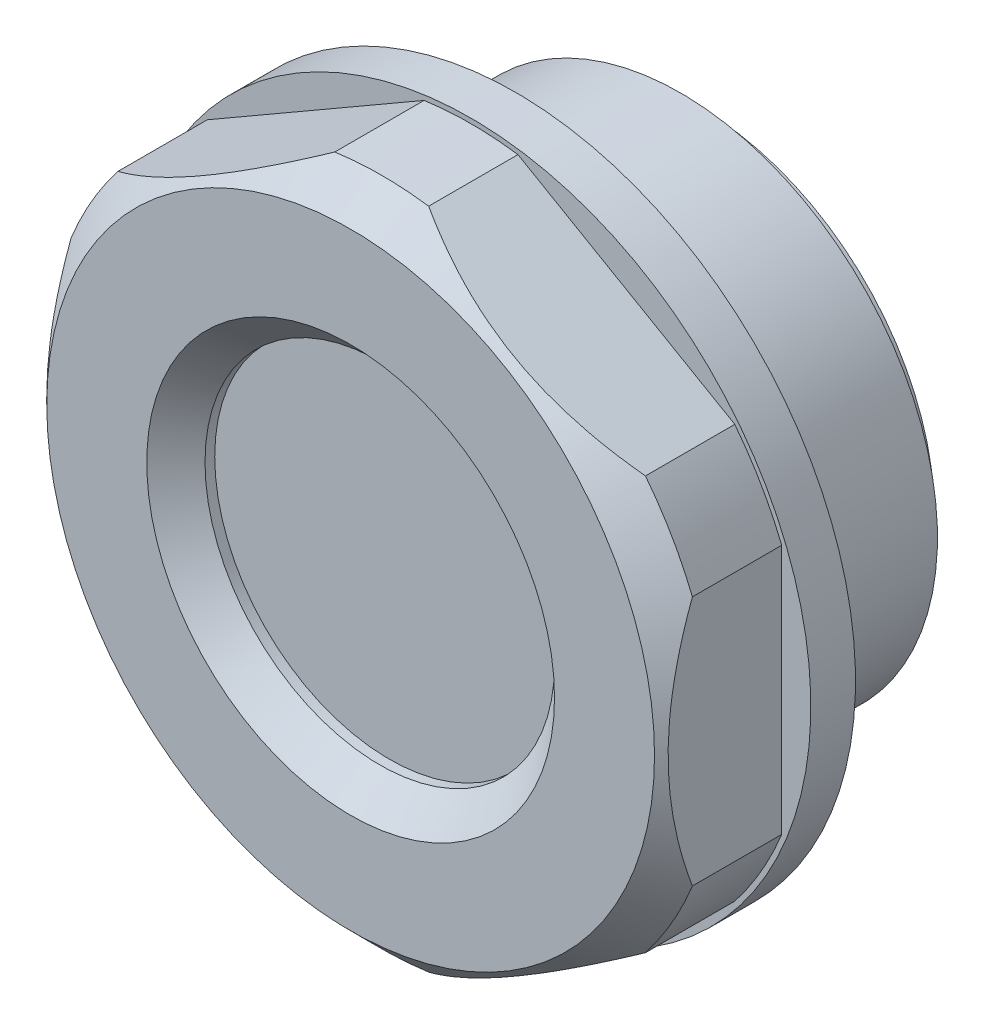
ISO-10303-21;
HEADER;
FILE_DESCRIPTION(('STEP AP214'),'2;1');
FILE_NAME('part.step','',(''),(''),'','','');
FILE_SCHEMA(('AUTOMOTIVE_DESIGN { 1 0 10303 214 1 1 1 1 }'));
ENDSEC;
DATA;
#1=APPLICATION_CONTEXT('core data for automotive mechanical design processes');
#2=APPLICATION_PROTOCOL_DEFINITION('international standard','automotive_design',2000,#1);
#3=PRODUCT_CONTEXT('',#1,'mechanical');
#4=PRODUCT('Part','Part','',(#3));
#5=PRODUCT_RELATED_PRODUCT_CATEGORY('part','',(#4));
#6=PRODUCT_DEFINITION_FORMATION('','',#4);
#7=PRODUCT_DEFINITION_CONTEXT('part definition',#1,'design');
#8=PRODUCT_DEFINITION('design','',#6,#7);
#9=PRODUCT_DEFINITION_SHAPE('','',#8);
#10=(LENGTH_UNIT() NAMED_UNIT(*) SI_UNIT(.MILLI.,.METRE.));
#11=(NAMED_UNIT(*) PLANE_ANGLE_UNIT() SI_UNIT($,.RADIAN.));
#12=(NAMED_UNIT(*) SI_UNIT($,.STERADIAN.) SOLID_ANGLE_UNIT());
#13=UNCERTAINTY_MEASURE_WITH_UNIT(LENGTH_MEASURE(1.E-05),#10,'distance_accuracy_value','');
#14=(GEOMETRIC_REPRESENTATION_CONTEXT(3) GLOBAL_UNCERTAINTY_ASSIGNED_CONTEXT((#13)) GLOBAL_UNIT_ASSIGNED_CONTEXT((#10,
#11,#12)) REPRESENTATION_CONTEXT('',''));
#15=CARTESIAN_POINT('',(0.,0.,0.));
#16=DIRECTION('',(0.,0.,1.));
#17=DIRECTION('',(1.,0.,0.));
#18=AXIS2_PLACEMENT_3D('',#15,#16,#17);
#19=CARTESIAN_POINT('',(-1.20657560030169E-13,0.,7.90000000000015));
#20=DIRECTION('',(0.,0.,-1.));
#21=DIRECTION('',(-1.,0.,0.));
#22=AXIS2_PLACEMENT_3D('',#19,#20,#21);
#23=CONICAL_SURFACE('',#22,17.25,0.785398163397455);
#24=CARTESIAN_POINT('',(-1.45094534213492E-13,0.,9.5));
#25=DIRECTION('',(0.,0.,-1.));
#26=DIRECTION('',(-1.,0.,0.));
#27=AXIS2_PLACEMENT_3D('',#24,#25,#26);
#28=CIRCLE('',#27,15.65);
#29=CARTESIAN_POINT('',(-15.6500000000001,0.,9.49999999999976));
#30=VERTEX_POINT('',#29);
#31=EDGE_CURVE('E256',#30,#30,#28,.T.);
#32=ORIENTED_EDGE('',*,*,#31,.T.);
#33=EDGE_LOOP('',(#32));
#34=FACE_BOUND('',#33,.T.);
#35=CARTESIAN_POINT('',(-1.20657560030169E-13,0.,7.90000000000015));
#36=DIRECTION('',(0.,0.,-1.));
#37=DIRECTION('',(-1.,0.,0.));
#38=AXIS2_PLACEMENT_3D('',#35,#36,#37);
#39=CIRCLE('',#38,17.25);
#40=CARTESIAN_POINT('',(-2.41682214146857,17.0798557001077,7.90000000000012));
#41=VERTEX_POINT('',#40);
#42=CARTESIAN_POINT('',(2.41682214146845,17.0798557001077,7.90000000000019));
#43=VERTEX_POINT('',#42);
#44=EDGE_CURVE('E257',#41,#43,#39,.T.);
#45=ORIENTED_EDGE('',*,*,#44,.F.);
#46=CARTESIAN_POINT('',(-2.41635871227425,17.0801232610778,7.89980000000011));
#47=CARTESIAN_POINT('',(-2.63984946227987,16.9510908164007,7.99624456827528));
#48=CARTESIAN_POINT('',(-2.86473179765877,16.8212549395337,8.08832370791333));
#49=CARTESIAN_POINT('',(-3.31735921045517,16.5599303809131,8.26286508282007));
#50=CARTESIAN_POINT('',(-3.54510524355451,16.4284411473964,8.34532400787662));
#51=CARTESIAN_POINT('',(-4.23352860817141,16.0309797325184,8.57718261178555));
#52=CARTESIAN_POINT('',(-4.69841380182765,15.7625781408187,8.71063418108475));
#53=CARTESIAN_POINT('',(-5.39388764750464,15.3610461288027,8.87148738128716));
#54=CARTESIAN_POINT('',(-5.62125425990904,15.2297759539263,8.91803441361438));
#55=CARTESIAN_POINT('',(-6.07760865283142,14.9662996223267,8.99884693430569));
#56=CARTESIAN_POINT('',(-6.30659618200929,14.8340936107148,9.03311428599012));
#57=CARTESIAN_POINT('',(-6.76547632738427,14.5691590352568,9.08878220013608));
#58=CARTESIAN_POINT('',(-6.99536760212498,14.4364312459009,9.11019749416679));
#59=CARTESIAN_POINT('',(-7.45578938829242,14.1706066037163,9.13986408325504));
#60=CARTESIAN_POINT('',(-7.6863198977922,14.0375097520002,9.14811541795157));
#61=CARTESIAN_POINT('',(-8.15412172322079,13.7674242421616,9.15135511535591));
#62=CARTESIAN_POINT('',(-8.3913951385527,13.6304343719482,9.14595293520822));
#63=CARTESIAN_POINT('',(-8.86539361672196,13.3567712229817,9.1211573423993));
#64=CARTESIAN_POINT('',(-9.10211867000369,13.2200979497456,9.10176368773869));
#65=CARTESIAN_POINT('',(-9.57473063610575,12.9472353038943,9.04930119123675));
#66=CARTESIAN_POINT('',(-9.81061608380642,12.8110467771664,9.0162148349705));
#67=CARTESIAN_POINT('',(-10.2807313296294,12.5396256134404,8.93693320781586));
#68=CARTESIAN_POINT('',(-10.5149610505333,12.4043930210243,8.89073732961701));
#69=CARTESIAN_POINT('',(-10.9900220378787,12.1301164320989,8.78402160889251));
#70=CARTESIAN_POINT('',(-11.2307738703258,11.9911182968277,8.72303196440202));
#71=CARTESIAN_POINT('',(-11.7096941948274,11.7146135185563,8.58868532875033));
#72=CARTESIAN_POINT('',(-11.9478623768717,11.5771070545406,8.51532687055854));
#73=CARTESIAN_POINT('',(-12.4207353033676,11.3040937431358,8.35747009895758));
#74=CARTESIAN_POINT('',(-12.6554473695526,11.1685826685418,8.27300086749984));
#75=CARTESIAN_POINT('',(-13.1218299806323,10.8993165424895,8.09382652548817));
#76=CARTESIAN_POINT('',(-13.3535016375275,10.7655608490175,7.9991252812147));
#77=CARTESIAN_POINT('',(-13.5836412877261,10.632689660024,7.8998));
#78=B_SPLINE_CURVE_WITH_KNOTS('',3,(#46,#47,#48,#49,#50,#51,#52,#53,#54,#55,#56,#57,#58,#59,#60,
#61,#62,#63,#64,#65,#66,#67,#68,#69,#70,#71,#72,#73,#74,#75,#76,#77),.UNSPECIFIED.,.F.,.F.,(4,2,
2,2,2,2,2,2,2,2,2,2,2,2,2,4),(0.,0.8263902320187,1.65306398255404,3.31002575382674,
4.10970222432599,4.90925730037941,5.70789413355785,6.50652856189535,7.32826394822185,
8.1500135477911,8.97281751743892,9.79565961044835,10.6491778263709,11.5027973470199,
12.3542254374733,13.2053329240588),.UNSPECIFIED.);
#79=CARTESIAN_POINT('',(-13.5831778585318,10.6329572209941,7.9));
#80=VERTEX_POINT('',#79);
#81=EDGE_CURVE('E123',#41,#80,#78,.T.);
#82=ORIENTED_EDGE('',*,*,#81,.T.);
#83=CARTESIAN_POINT('',(-16.,6.44689847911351,7.9));
#84=VERTEX_POINT('',#83);
#85=EDGE_CURVE('E122',#84,#80,#39,.T.);
#86=ORIENTED_EDGE('',*,*,#85,.F.);
#87=CARTESIAN_POINT('',(-16.,-18.6480764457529,0.578659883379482));
#88=CARTESIAN_POINT('',(-15.9999999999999,-18.4215574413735,0.750570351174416));
#89=CARTESIAN_POINT('',(-15.9999999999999,-18.1944022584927,0.921641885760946));
#90=CARTESIAN_POINT('',(-15.9999999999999,-17.7387144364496,1.26194848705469));
#91=CARTESIAN_POINT('',(-15.9999999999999,-17.510181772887,1.4311835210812));
#92=CARTESIAN_POINT('',(-15.9999999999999,-16.8222665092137,1.93596425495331));
#93=CARTESIAN_POINT('',(-15.9999999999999,-16.3606707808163,2.26850632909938));
#94=CARTESIAN_POINT('',(-15.9999999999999,-15.4270758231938,2.92649586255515));
#95=CARTESIAN_POINT('',(-15.9999999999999,-14.9550237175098,3.25186846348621));
#96=CARTESIAN_POINT('',(-15.9999999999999,-14.0029474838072,3.89069769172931));
#97=CARTESIAN_POINT('',(-15.9999999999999,-13.5229239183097,4.20415515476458));
#98=CARTESIAN_POINT('',(-16.,-12.5251227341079,4.83447992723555));
#99=CARTESIAN_POINT('',(-16.,-12.0067846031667,5.15046438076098));
#100=CARTESIAN_POINT('',(-16.,-10.9579857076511,5.76196555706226));
#101=CARTESIAN_POINT('',(-16.,-10.4275230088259,6.05747898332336));
#102=CARTESIAN_POINT('',(-16.,-9.35447527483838,6.62168298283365));
#103=CARTESIAN_POINT('',(-16.,-8.81193202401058,6.89045241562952));
#104=CARTESIAN_POINT('',(-16.,-7.71189356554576,7.39515029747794));
#105=CARTESIAN_POINT('',(-16.,-7.15440534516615,7.63109378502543));
#106=CARTESIAN_POINT('',(-16.,-6.07190242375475,8.0432913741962));
#107=CARTESIAN_POINT('',(-16.,-5.54818492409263,8.22292359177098));
#108=CARTESIAN_POINT('',(-16.0000000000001,-4.48784556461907,8.54020255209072));
#109=CARTESIAN_POINT('',(-16.0000000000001,-3.9512228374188,8.67784646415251));
#110=CARTESIAN_POINT('',(-16.0000000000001,-3.14356845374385,8.84619118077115));
#111=CARTESIAN_POINT('',(-16.0000000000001,-2.87637386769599,8.89566579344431));
#112=CARTESIAN_POINT('',(-16.0000000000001,-2.33996090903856,8.98196309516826));
#113=CARTESIAN_POINT('',(-16.0000000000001,-2.07074281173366,9.01878747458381));
#114=CARTESIAN_POINT('',(-16.0000000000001,-1.53083914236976,9.07917233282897));
#115=CARTESIAN_POINT('',(-16.0000000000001,-1.26015367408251,9.10273373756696));
#116=CARTESIAN_POINT('',(-16.0000000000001,-0.717935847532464,9.13618645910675));
#117=CARTESIAN_POINT('',(-16.,-0.446403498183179,9.14607791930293));
#118=CARTESIAN_POINT('',(-16.,0.0864482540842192,9.15189931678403));
#119=CARTESIAN_POINT('',(-16.0000000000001,0.347762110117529,9.14834746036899));
#120=CARTESIAN_POINT('',(-16.0000000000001,0.869931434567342,9.12849252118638));
#121=CARTESIAN_POINT('',(-16.0000000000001,1.13078684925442,9.11218803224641));
#122=CARTESIAN_POINT('',(-16.0000000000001,1.6514011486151,9.06709326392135));
#123=CARTESIAN_POINT('',(-16.0000000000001,1.91116008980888,9.03830363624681));
#124=CARTESIAN_POINT('',(-16.0000000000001,2.42907351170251,8.96869979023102));
#125=CARTESIAN_POINT('',(-16.0000000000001,2.68722778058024,8.9278840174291));
#126=CARTESIAN_POINT('',(-16.0000000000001,3.46755429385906,8.78663950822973));
#127=CARTESIAN_POINT('',(-16.0000000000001,3.98654918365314,8.66822454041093));
#128=CARTESIAN_POINT('',(-16.0000000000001,5.01311061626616,8.3903272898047));
#129=CARTESIAN_POINT('',(-16.,5.52067803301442,8.23084815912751));
#130=CARTESIAN_POINT('',(-16.,6.56542694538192,7.86283095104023));
#131=CARTESIAN_POINT('',(-16.0000000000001,7.10154915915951,7.65131116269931));
#132=CARTESIAN_POINT('',(-16.0000000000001,8.15990175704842,7.19573573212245));
#133=CARTESIAN_POINT('',(-16.0000000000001,8.68212559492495,6.95166507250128));
#134=CARTESIAN_POINT('',(-16.0000000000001,9.71521766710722,6.43678880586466));
#135=CARTESIAN_POINT('',(-16.0000000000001,10.2260439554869,6.1658997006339));
#136=CARTESIAN_POINT('',(-16.0000000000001,11.2359556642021,5.60336675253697));
#137=CARTESIAN_POINT('',(-16.0000000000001,11.7350429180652,5.31172617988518));
#138=CARTESIAN_POINT('',(-16.0000000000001,12.6985093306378,4.72665329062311));
#139=CARTESIAN_POINT('',(-16.0000000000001,13.163381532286,4.43402866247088));
#140=CARTESIAN_POINT('',(-16.0000000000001,14.0851437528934,3.83643255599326));
#141=CARTESIAN_POINT('',(-16.0000000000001,14.5420331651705,3.53146014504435));
#142=CARTESIAN_POINT('',(-16.0000000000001,15.4451754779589,2.91386308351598));
#143=CARTESIAN_POINT('',(-16.0000000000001,15.8914845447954,2.60132037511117));
#144=CARTESIAN_POINT('',(-16.0000000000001,16.5564097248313,2.12630120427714));
#145=CARTESIAN_POINT('',(-16.0000000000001,16.777267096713,1.96694806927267));
#146=CARTESIAN_POINT('',(-16.0000000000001,17.2175840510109,1.64633107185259));
#147=CARTESIAN_POINT('',(-16.,17.4370436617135,1.48506724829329));
#148=CARTESIAN_POINT('',(-16.,17.6558565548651,1.32292987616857));
#149=B_SPLINE_CURVE_WITH_KNOTS('',3,(#87,#88,#89,#90,#91,#92,#93,#94,#95,#96,#97,#98,#99,#100,
#101,#102,#103,#104,#105,#106,#107,#108,#109,#110,#111,#112,#113,#114,#115,#116,#117,#118,#119,
#120,#121,#122,#123,#124,#125,#126,#127,#128,#129,#130,#131,#132,#133,#134,#135,#136,#137,#138,
#139,#140,#141,#142,#143,#144,#145,#146,#147,#148),.UNSPECIFIED.,.F.,.F.,(4,2,2,2,2,2,2,2,2,2,2,
2,2,2,2,2,2,2,2,2,2,2,2,2,2,2,2,2,2,2,4),(0.,0.853094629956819,1.70620441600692,
3.41281655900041,5.13264126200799,6.85234511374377,8.67314670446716,10.4942408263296,
12.3097952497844,14.1245151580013,15.7841253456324,17.4438473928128,18.2588053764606,
19.0736544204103,19.8884465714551,20.7032301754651,21.4869316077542,22.2707194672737,
23.0544664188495,23.8383147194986,25.4331404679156,27.02784383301,28.7555072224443,
30.4839704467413,32.217995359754,33.9517476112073,35.5994304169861,37.2472379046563,
38.8817047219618,39.6987292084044,40.5157371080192),.UNSPECIFIED.);
#150=CARTESIAN_POINT('',(-16.,-6.44689847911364,7.89999999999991));
#151=VERTEX_POINT('',#150);
#152=EDGE_CURVE('E246',#84,#151,#149,.F.);
#153=ORIENTED_EDGE('',*,*,#152,.T.);
#154=CARTESIAN_POINT('',(-13.5831778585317,-10.6329572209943,7.9));
#155=VERTEX_POINT('',#154);
#156=EDGE_CURVE('E130',#155,#151,#39,.T.);
#157=ORIENTED_EDGE('',*,*,#156,.F.);
#158=CARTESIAN_POINT('',(-13.583641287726,-10.6326896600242,7.8998));
#159=CARTESIAN_POINT('',(-13.3601505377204,-10.7617221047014,7.99624456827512));
#160=CARTESIAN_POINT('',(-13.1352682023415,-10.8915579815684,8.08832370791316));
#161=CARTESIAN_POINT('',(-12.6826407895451,-11.152882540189,8.2628650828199));
#162=CARTESIAN_POINT('',(-12.4548947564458,-11.2843717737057,8.34532400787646));
#163=CARTESIAN_POINT('',(-11.7664713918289,-11.6818331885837,8.57718261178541));
#164=CARTESIAN_POINT('',(-11.3015861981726,-11.9502347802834,8.71063418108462));
#165=CARTESIAN_POINT('',(-10.6061123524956,-12.3517667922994,8.87148738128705));
#166=CARTESIAN_POINT('',(-10.3787457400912,-12.4830369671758,8.91803441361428));
#167=CARTESIAN_POINT('',(-9.92239134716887,-12.7465132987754,8.9988469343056));
#168=CARTESIAN_POINT('',(-9.693403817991,-12.8787193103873,9.03311428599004));
#169=CARTESIAN_POINT('',(-9.23452367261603,-13.1436538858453,9.08878220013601));
#170=CARTESIAN_POINT('',(-9.00463239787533,-13.2763816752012,9.11019749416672));
#171=CARTESIAN_POINT('',(-8.54421061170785,-13.5422063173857,9.139864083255));
#172=CARTESIAN_POINT('',(-8.31368010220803,-13.6753031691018,9.14811541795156));
#173=CARTESIAN_POINT('',(-7.84587827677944,-13.9453886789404,9.15135511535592));
#174=CARTESIAN_POINT('',(-7.60860486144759,-14.0823785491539,9.14595293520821));
#175=CARTESIAN_POINT('',(-7.13460638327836,-14.3560416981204,9.12115734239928));
#176=CARTESIAN_POINT('',(-6.89788132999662,-14.4927149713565,9.10176368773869));
#177=CARTESIAN_POINT('',(-6.42526936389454,-14.7655776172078,9.04930119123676));
#178=CARTESIAN_POINT('',(-6.18938391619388,-14.9017661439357,9.01621483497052));
#179=CARTESIAN_POINT('',(-5.71926867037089,-15.1731873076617,8.93693320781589));
#180=CARTESIAN_POINT('',(-5.48503894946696,-15.3084199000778,8.89073732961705));
#181=CARTESIAN_POINT('',(-5.00997796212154,-15.5826964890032,8.78402160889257));
#182=CARTESIAN_POINT('',(-4.76922612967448,-15.7216946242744,8.72303196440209));
#183=CARTESIAN_POINT('',(-4.29030580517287,-15.9981994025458,8.58868532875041));
#184=CARTESIAN_POINT('',(-4.05213762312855,-16.1357058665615,8.51532687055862));
#185=CARTESIAN_POINT('',(-3.5792646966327,-16.4087191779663,8.35747009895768));
#186=CARTESIAN_POINT('',(-3.3445526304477,-16.5442302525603,8.27300086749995));
#187=CARTESIAN_POINT('',(-2.87817001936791,-16.8134963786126,8.09382652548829));
#188=CARTESIAN_POINT('',(-2.64649836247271,-16.9472520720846,7.99912528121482));
#189=CARTESIAN_POINT('',(-2.41635871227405,-17.0801232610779,7.89980000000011));
#190=B_SPLINE_CURVE_WITH_KNOTS('',3,(#158,#159,#160,#161,#162,#163,#164,#165,#166,#167,#168,
#169,#170,#171,#172,#173,#174,#175,#176,#177,#178,#179,#180,#181,#182,#183,#184,#185,#186,#187,
#188,#189),.UNSPECIFIED.,.F.,.F.,(4,2,2,2,2,2,2,2,2,2,2,2,2,2,2,4),(0.,0.826390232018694,
1.65306398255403,3.31002575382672,4.10970222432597,4.90925730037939,5.70789413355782,
6.50652856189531,7.32826394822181,8.15001354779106,8.97281751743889,9.79565961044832,
10.6491778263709,11.5027973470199,12.3542254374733,13.2053329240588),.UNSPECIFIED.);
#191=CARTESIAN_POINT('',(-2.41682214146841,-17.0798557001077,7.90000000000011));
#192=VERTEX_POINT('',#191);
#193=EDGE_CURVE('E233',#155,#192,#190,.T.);
#194=ORIENTED_EDGE('',*,*,#193,.T.);
#195=CARTESIAN_POINT('',(2.41682214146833,-17.0798557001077,7.90000000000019));
#196=VERTEX_POINT('',#195);
#197=EDGE_CURVE('E135',#196,#192,#39,.T.);
#198=ORIENTED_EDGE('',*,*,#197,.F.);
#199=CARTESIAN_POINT('',(2.41635871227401,-17.0801232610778,7.89980000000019));
#200=CARTESIAN_POINT('',(2.63984946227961,-16.9510908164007,7.99624456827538));
#201=CARTESIAN_POINT('',(2.8647317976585,-16.8212549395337,8.08832370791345));
#202=CARTESIAN_POINT('',(3.3173592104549,-16.5599303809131,8.26286508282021));
#203=CARTESIAN_POINT('',(3.54510524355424,-16.4284411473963,8.34532400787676));
#204=CARTESIAN_POINT('',(4.23352860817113,-16.0309797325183,8.57718261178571));
#205=CARTESIAN_POINT('',(4.69841380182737,-15.7625781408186,8.71063418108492));
#206=CARTESIAN_POINT('',(5.39388764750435,-15.3610461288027,8.87148738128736));
#207=CARTESIAN_POINT('',(5.62125425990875,-15.2297759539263,8.91803441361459));
#208=CARTESIAN_POINT('',(6.07760865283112,-14.9662996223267,8.99884693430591));
#209=CARTESIAN_POINT('',(6.30659618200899,-14.8340936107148,9.03311428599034));
#210=CARTESIAN_POINT('',(6.76547632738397,-14.5691590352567,9.08878220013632));
#211=CARTESIAN_POINT('',(6.99536760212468,-14.4364312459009,9.11019749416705));
#212=CARTESIAN_POINT('',(7.45578938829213,-14.1706066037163,9.13986408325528));
#213=CARTESIAN_POINT('',(7.68631989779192,-14.0375097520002,9.1481154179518));
#214=CARTESIAN_POINT('',(8.15412172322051,-13.7674242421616,9.15135511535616));
#215=CARTESIAN_POINT('',(8.39139513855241,-13.6304343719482,9.1459529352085));
#216=CARTESIAN_POINT('',(8.86539361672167,-13.3567712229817,9.12115734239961));
#217=CARTESIAN_POINT('',(9.1021186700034,-13.2200979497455,9.101763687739));
#218=CARTESIAN_POINT('',(9.57473063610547,-12.9472353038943,9.04930119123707));
#219=CARTESIAN_POINT('',(9.81061608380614,-12.8110467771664,9.01621483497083));
#220=CARTESIAN_POINT('',(10.2807313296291,-12.5396256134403,8.9369332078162));
#221=CARTESIAN_POINT('',(10.5149610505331,-12.4043930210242,8.89073732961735));
#222=CARTESIAN_POINT('',(10.9900220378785,-12.1301164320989,8.78402160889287));
#223=CARTESIAN_POINT('',(11.2307738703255,-11.9911182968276,8.72303196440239));
#224=CARTESIAN_POINT('',(11.7096941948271,-11.7146135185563,8.58868532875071));
#225=CARTESIAN_POINT('',(11.9478623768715,-11.5771070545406,8.51532687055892));
#226=CARTESIAN_POINT('',(12.4207353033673,-11.3040937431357,8.35747009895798));
#227=CARTESIAN_POINT('',(12.6554473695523,-11.1685826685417,8.27300086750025));
#228=CARTESIAN_POINT('',(13.1218299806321,-10.8993165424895,8.09382652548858));
#229=CARTESIAN_POINT('',(13.3535016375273,-10.7655608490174,7.99912528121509));
#230=CARTESIAN_POINT('',(13.5836412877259,-10.632689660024,7.89980000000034));
#231=B_SPLINE_CURVE_WITH_KNOTS('',3,(#199,#200,#201,#202,#203,#204,#205,#206,#207,#208,#209,
#210,#211,#212,#213,#214,#215,#216,#217,#218,#219,#220,#221,#222,#223,#224,#225,#226,#227,#228,
#229,#230),.UNSPECIFIED.,.F.,.F.,(4,2,2,2,2,2,2,2,2,2,2,2,2,2,2,4),(0.,0.826390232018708,
1.65306398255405,3.31002575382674,4.10970222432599,4.90925730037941,5.70789413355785,
6.50652856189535,7.32826394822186,8.15001354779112,8.97281751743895,9.79565961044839,
10.6491778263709,11.5027973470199,12.3542254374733,13.2053329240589),.UNSPECIFIED.);
#232=CARTESIAN_POINT('',(13.5831778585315,-10.6329572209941,7.90000000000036));
#233=VERTEX_POINT('',#232);
#234=EDGE_CURVE('E219',#196,#233,#231,.T.);
#235=ORIENTED_EDGE('',*,*,#234,.T.);
#236=CARTESIAN_POINT('',(16.,-6.4468984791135,7.9000000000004));
#237=VERTEX_POINT('',#236);
#238=EDGE_CURVE('E510',#237,#233,#39,.T.);
#239=ORIENTED_EDGE('',*,*,#238,.F.);
#240=CARTESIAN_POINT('',(16.,-18.6480764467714,0.578659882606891));
#241=CARTESIAN_POINT('',(16.,-18.4215574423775,0.750570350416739));
#242=CARTESIAN_POINT('',(16.,-18.1944022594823,0.921641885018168));
#243=CARTESIAN_POINT('',(16.,-17.7387144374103,1.26194848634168));
#244=CARTESIAN_POINT('',(16.,-17.5101817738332,1.43118352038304));
#245=CARTESIAN_POINT('',(16.,-16.8222665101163,1.93596425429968));
#246=CARTESIAN_POINT('',(16.,-16.3606707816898,2.26850632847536));
#247=CARTESIAN_POINT('',(16.,-15.4270758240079,2.92649586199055));
#248=CARTESIAN_POINT('',(16.,-14.9550237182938,3.25186846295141));
#249=CARTESIAN_POINT('',(16.,-14.0029474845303,3.89069769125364));
#250=CARTESIAN_POINT('',(16.,-13.522923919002,4.20415515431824));
#251=CARTESIAN_POINT('',(15.9999999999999,-12.525122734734,4.83447992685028));
#252=CARTESIAN_POINT('',(15.9999999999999,-12.0067846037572,5.15046438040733));
#253=CARTESIAN_POINT('',(15.9999999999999,-10.9579857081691,5.76196555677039));
#254=CARTESIAN_POINT('',(15.9999999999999,-10.427523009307,6.05747898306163));
#255=CARTESIAN_POINT('',(15.9999999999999,-9.35447527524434,6.62168298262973));
#256=CARTESIAN_POINT('',(15.9999999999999,-8.81193202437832,6.89045241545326));
#257=CARTESIAN_POINT('',(15.9999999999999,-7.71189356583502,7.39515029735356));
#258=CARTESIAN_POINT('',(16.,-7.15440534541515,7.63109378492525));
#259=CARTESIAN_POINT('',(16.,-6.07190242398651,8.04329137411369));
#260=CARTESIAN_POINT('',(15.9999999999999,-5.54818492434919,8.22292359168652));
#261=CARTESIAN_POINT('',(15.9999999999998,-4.48784556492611,8.54020255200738));
#262=CARTESIAN_POINT('',(15.9999999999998,-3.9512228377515,8.67784646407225));
#263=CARTESIAN_POINT('',(15.9999999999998,-3.14356845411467,8.84619118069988));
#264=CARTESIAN_POINT('',(15.9999999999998,-2.87637386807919,8.89566579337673));
#265=CARTESIAN_POINT('',(15.9999999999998,-2.33996090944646,8.98196309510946));
#266=CARTESIAN_POINT('',(15.9999999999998,-2.07074281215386,9.01878747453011));
#267=CARTESIAN_POINT('',(15.9999999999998,-1.53083914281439,9.07917233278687));
#268=CARTESIAN_POINT('',(15.9999999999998,-1.26015367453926,9.10273373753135));
#269=CARTESIAN_POINT('',(15.9999999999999,-0.717935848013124,9.13618645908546));
#270=CARTESIAN_POINT('',(16.,-0.446403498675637,9.14607791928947));
#271=CARTESIAN_POINT('',(16.,0.0864482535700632,9.15189931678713));
#272=CARTESIAN_POINT('',(15.9999999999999,0.347762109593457,9.14834746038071));
#273=CARTESIAN_POINT('',(15.9999999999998,0.869931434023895,9.12849252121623));
#274=CARTESIAN_POINT('',(15.9999999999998,1.13078684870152,9.11218803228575));
#275=CARTESIAN_POINT('',(15.9999999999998,1.65140114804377,9.06709326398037));
#276=CARTESIAN_POINT('',(15.9999999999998,1.91116008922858,9.03830363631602));
#277=CARTESIAN_POINT('',(15.9999999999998,2.42907351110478,8.96869979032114));
#278=CARTESIAN_POINT('',(15.9999999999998,2.68722777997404,8.92788401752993));
#279=CARTESIAN_POINT('',(15.9999999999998,3.46755429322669,8.78663950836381));
#280=CARTESIAN_POINT('',(15.9999999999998,3.98654918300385,8.66822454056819));
#281=CARTESIAN_POINT('',(15.9999999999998,5.0131106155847,8.39032729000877));
#282=CARTESIAN_POINT('',(16.,5.52067803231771,8.23084815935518));
#283=CARTESIAN_POINT('',(16.,6.56542694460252,7.86283095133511));
#284=CARTESIAN_POINT('',(15.9999999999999,7.10154915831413,7.65131116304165));
#285=CARTESIAN_POINT('',(15.9999999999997,8.15990175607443,7.1957357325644));
#286=CARTESIAN_POINT('',(15.9999999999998,8.68212559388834,6.95166507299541));
#287=CARTESIAN_POINT('',(15.9999999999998,9.71521766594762,6.43678880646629));
#288=CARTESIAN_POINT('',(15.9999999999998,10.2260439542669,6.16589970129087));
#289=CARTESIAN_POINT('',(15.9999999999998,11.2359556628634,5.60336675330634));
#290=CARTESIAN_POINT('',(15.9999999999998,11.7350429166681,5.31172618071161));
#291=CARTESIAN_POINT('',(15.9999999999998,12.6985093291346,4.72665329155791));
#292=CARTESIAN_POINT('',(15.9999999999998,13.1633815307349,4.43402866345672));
#293=CARTESIAN_POINT('',(15.9999999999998,14.0851437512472,3.83643255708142));
#294=CARTESIAN_POINT('',(15.9999999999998,14.5420331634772,3.53146014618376));
#295=CARTESIAN_POINT('',(15.9999999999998,15.4451754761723,2.91386308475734));
#296=CARTESIAN_POINT('',(15.9999999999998,15.8914845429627,2.6013203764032));
#297=CARTESIAN_POINT('',(15.9999999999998,16.5564097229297,2.12630120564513));
#298=CARTESIAN_POINT('',(15.9999999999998,16.7772670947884,1.96694807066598));
#299=CARTESIAN_POINT('',(15.9999999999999,17.2175840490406,1.6463310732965));
#300=CARTESIAN_POINT('',(15.9999999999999,17.4370436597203,1.48506724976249));
#301=CARTESIAN_POINT('',(16.,17.6558565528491,1.32292987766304));
#302=B_SPLINE_CURVE_WITH_KNOTS('',3,(#240,#241,#242,#243,#244,#245,#246,#247,#248,#249,#250,
#251,#252,#253,#254,#255,#256,#257,#258,#259,#260,#261,#262,#263,#264,#265,#266,#267,#268,#269,
#270,#271,#272,#273,#274,#275,#276,#277,#278,#279,#280,#281,#282,#283,#284,#285,#286,#287,#288,
#289,#290,#291,#292,#293,#294,#295,#296,#297,#298,#299,#300,#301),.UNSPECIFIED.,.F.,.F.,(4,2,2,
2,2,2,2,2,2,2,2,2,2,2,2,2,2,2,2,2,2,2,2,2,2,2,2,2,2,2,4),(0.,0.853094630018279,1.70620441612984,
3.41281655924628,5.13264126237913,6.85234511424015,8.67314670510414,10.4942408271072,
12.3097952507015,14.1245151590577,15.7841253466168,17.4438473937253,18.2588053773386,
19.0736544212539,19.8884465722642,20.7032301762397,21.4869316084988,22.2707194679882,
23.0544664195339,23.8383147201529,25.433140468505,27.0278438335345,28.7555072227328,
30.4839704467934,32.2179953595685,33.9517476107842,35.5994304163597,37.2472379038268,
38.8817047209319,39.6987292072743,40.5157371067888),.UNSPECIFIED.);
#303=CARTESIAN_POINT('',(16.,6.44689847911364,7.9000000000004));
#304=VERTEX_POINT('',#303);
#305=EDGE_CURVE('E195',#237,#304,#302,.T.);
#306=ORIENTED_EDGE('',*,*,#305,.T.);
#307=CARTESIAN_POINT('',(13.5831778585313,10.6329572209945,7.90000000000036));
#308=VERTEX_POINT('',#307);
#309=EDGE_CURVE('E262',#308,#304,#39,.T.);
#310=ORIENTED_EDGE('',*,*,#309,.F.);
#311=CARTESIAN_POINT('',(13.5836412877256,10.6326896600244,7.89980000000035));
#312=CARTESIAN_POINT('',(13.36015053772,10.7617221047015,7.99624456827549));
#313=CARTESIAN_POINT('',(13.1352682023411,10.8915579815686,8.08832370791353));
#314=CARTESIAN_POINT('',(12.6826407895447,11.1528825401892,8.26286508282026));
#315=CARTESIAN_POINT('',(12.4548947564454,11.2843717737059,8.3453240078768));
#316=CARTESIAN_POINT('',(11.7664713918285,11.6818331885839,8.57718261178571));
#317=CARTESIAN_POINT('',(11.3015861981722,11.9502347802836,8.7106341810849));
#318=CARTESIAN_POINT('',(10.6061123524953,12.3517667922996,8.8714873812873));
#319=CARTESIAN_POINT('',(10.3787457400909,12.483036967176,8.91803441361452));
#320=CARTESIAN_POINT('',(9.9223913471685,12.7465132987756,8.99884693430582));
#321=CARTESIAN_POINT('',(9.69340381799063,12.8787193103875,9.03311428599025));
#322=CARTESIAN_POINT('',(9.23452367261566,13.1436538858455,9.08878220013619));
#323=CARTESIAN_POINT('',(9.00463239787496,13.2763816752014,9.1101974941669));
#324=CARTESIAN_POINT('',(8.54421061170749,13.5422063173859,9.13986408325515));
#325=CARTESIAN_POINT('',(8.31368010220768,13.675303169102,9.14811541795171));
#326=CARTESIAN_POINT('',(7.8458782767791,13.9453886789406,9.15135511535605));
#327=CARTESIAN_POINT('',(7.60860486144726,14.082378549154,9.14595293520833));
#328=CARTESIAN_POINT('',(7.13460638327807,14.3560416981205,9.12115734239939));
#329=CARTESIAN_POINT('',(6.89788132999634,14.4927149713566,9.10176368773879));
#330=CARTESIAN_POINT('',(6.4252693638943,14.7655776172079,9.04930119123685));
#331=CARTESIAN_POINT('',(6.18938391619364,14.9017661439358,9.01621483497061));
#332=CARTESIAN_POINT('',(5.7192686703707,15.1731873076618,8.93693320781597));
#333=CARTESIAN_POINT('',(5.48503894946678,15.3084199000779,8.89073732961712));
#334=CARTESIAN_POINT('',(5.00997796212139,15.5826964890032,8.78402160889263));
#335=CARTESIAN_POINT('',(4.76922612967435,15.7216946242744,8.72303196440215));
#336=CARTESIAN_POINT('',(4.29030580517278,15.9981994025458,8.58868532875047));
#337=CARTESIAN_POINT('',(4.05213762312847,16.1357058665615,8.51532687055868));
#338=CARTESIAN_POINT('',(3.57926469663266,16.4087191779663,8.35747009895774));
#339=CARTESIAN_POINT('',(3.34455263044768,16.5442302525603,8.27300086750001));
#340=CARTESIAN_POINT('',(2.87817001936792,16.8134963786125,8.09382652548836));
#341=CARTESIAN_POINT('',(2.64649836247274,16.9472520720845,7.99912528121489));
#342=CARTESIAN_POINT('',(2.41635871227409,17.0801232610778,7.89980000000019));
#343=B_SPLINE_CURVE_WITH_KNOTS('',3,(#311,#312,#313,#314,#315,#316,#317,#318,#319,#320,#321,
#322,#323,#324,#325,#326,#327,#328,#329,#330,#331,#332,#333,#334,#335,#336,#337,#338,#339,#340,
#341,#342),.UNSPECIFIED.,.F.,.F.,(4,2,2,2,2,2,2,2,2,2,2,2,2,2,2,4),(0.,0.826390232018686,
1.65306398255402,3.31002575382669,4.10970222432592,4.90925730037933,5.70789413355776,
6.50652856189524,7.32826394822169,8.15001354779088,8.97281751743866,9.79565961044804,
10.6491778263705,11.5027973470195,12.3542254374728,13.2053329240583),.UNSPECIFIED.);
#344=EDGE_CURVE('E180',#308,#43,#343,.T.);
#345=ORIENTED_EDGE('',*,*,#344,.T.);
#346=EDGE_LOOP('',(#45,#82,#86,#153,#157,#194,#198,#235,#239,#306,#310,#345));
#347=FACE_BOUND('',#346,.T.);
#348=ADVANCED_FACE('F14',(#34,#347),#23,.T.);
#349=CARTESIAN_POINT('',(0.,0.,0.));
#350=DIRECTION('',(0.,0.,-1.));
#351=DIRECTION('',(-1.,0.,0.));
#352=AXIS2_PLACEMENT_3D('',#349,#350,#351);
#353=CYLINDRICAL_SURFACE('',#352,17.25);
#354=CARTESIAN_POINT('',(0.,0.,3.30000000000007));
#355=DIRECTION('',(0.,0.,-1.));
#356=DIRECTION('',(-1.,0.,0.));
#357=AXIS2_PLACEMENT_3D('',#354,#355,#356);
#358=CIRCLE('',#357,17.25);
#359=CARTESIAN_POINT('',(-2.41682214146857,17.0798557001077,3.30000000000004));
#360=VERTEX_POINT('',#359);
#361=CARTESIAN_POINT('',(2.41682214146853,17.0798557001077,3.30000000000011));
#362=VERTEX_POINT('',#361);
#363=EDGE_CURVE('E131',#360,#362,#358,.T.);
#364=ORIENTED_EDGE('',*,*,#363,.F.);
#365=DIRECTION('',(0.,0.,-1.));
#366=VECTOR('',#365,1.);
#367=CARTESIAN_POINT('',(-2.41682214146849,17.0798557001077,0.));
#368=LINE('',#367,#366);
#369=EDGE_CURVE('E109',#360,#41,#368,.F.);
#370=ORIENTED_EDGE('',*,*,#369,.T.);
#371=ORIENTED_EDGE('',*,*,#44,.T.);
#372=DIRECTION('',(0.,0.,-1.));
#373=VECTOR('',#372,1.);
#374=CARTESIAN_POINT('',(2.41682214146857,17.0798557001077,0.));
#375=LINE('',#374,#373);
#376=EDGE_CURVE('E189',#43,#362,#375,.T.);
#377=ORIENTED_EDGE('',*,*,#376,.T.);
#378=EDGE_LOOP('',(#364,#370,#371,#377));
#379=FACE_BOUND('',#378,.T.);
#380=ADVANCED_FACE('F291',(#379),#353,.T.);
#381=ORIENTED_EDGE('',*,*,#85,.T.);
#382=DIRECTION('',(0.,0.,-1.));
#383=VECTOR('',#382,1.);
#384=CARTESIAN_POINT('',(-13.5831778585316,10.6329572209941,-2.07457354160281E-13));
#385=LINE('',#384,#383);
#386=CARTESIAN_POINT('',(-13.5831778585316,10.6329572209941,3.29999999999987));
#387=VERTEX_POINT('',#386);
#388=EDGE_CURVE('E106',#80,#387,#385,.T.);
#389=ORIENTED_EDGE('',*,*,#388,.T.);
#390=CARTESIAN_POINT('',(-16.,6.44689847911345,3.29999999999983));
#391=VERTEX_POINT('',#390);
#392=EDGE_CURVE('E120',#391,#387,#358,.T.);
#393=ORIENTED_EDGE('',*,*,#392,.F.);
#394=DIRECTION('',(0.,0.,-1.));
#395=VECTOR('',#394,1.);
#396=CARTESIAN_POINT('',(-16.,6.44689847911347,-2.4436974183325E-13));
#397=LINE('',#396,#395);
#398=EDGE_CURVE('E124',#391,#84,#397,.F.);
#399=ORIENTED_EDGE('',*,*,#398,.T.);
#400=EDGE_LOOP('',(#381,#389,#393,#399));
#401=FACE_BOUND('',#400,.T.);
#402=ADVANCED_FACE('F118',(#401),#353,.T.);
#403=ORIENTED_EDGE('',*,*,#156,.T.);
#404=DIRECTION('',(0.,0.,-1.));
#405=VECTOR('',#404,1.);
#406=CARTESIAN_POINT('',(-16.,-6.44689847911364,-2.4436974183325E-13));
#407=LINE('',#406,#405);
#408=CARTESIAN_POINT('',(-16.,-6.44689847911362,3.29999999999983));
#409=VERTEX_POINT('',#408);
#410=EDGE_CURVE('E243',#151,#409,#407,.T.);
#411=ORIENTED_EDGE('',*,*,#410,.T.);
#412=CARTESIAN_POINT('',(-13.5831778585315,-10.6329572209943,3.29999999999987));
#413=VERTEX_POINT('',#412);
#414=EDGE_CURVE('E133',#413,#409,#358,.T.);
#415=ORIENTED_EDGE('',*,*,#414,.F.);
#416=DIRECTION('',(0.,0.,-1.));
#417=VECTOR('',#416,1.);
#418=CARTESIAN_POINT('',(-13.5831778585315,-10.6329572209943,-2.07457354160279E-13));
#419=LINE('',#418,#417);
#420=EDGE_CURVE('E240',#413,#155,#419,.F.);
#421=ORIENTED_EDGE('',*,*,#420,.T.);
#422=EDGE_LOOP('',(#403,#411,#415,#421));
#423=FACE_BOUND('',#422,.T.);
#424=ADVANCED_FACE('F443',(#423),#353,.T.);
#425=ORIENTED_EDGE('',*,*,#197,.T.);
#426=DIRECTION('',(0.,0.,-1.));
#427=VECTOR('',#426,1.);
#428=CARTESIAN_POINT('',(-2.41682214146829,-17.0798557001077,0.));
#429=LINE('',#428,#427);
#430=CARTESIAN_POINT('',(-2.41682214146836,-17.0798557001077,3.30000000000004));
#431=VERTEX_POINT('',#430);
#432=EDGE_CURVE('E230',#192,#431,#429,.T.);
#433=ORIENTED_EDGE('',*,*,#432,.T.);
#434=CARTESIAN_POINT('',(2.41682214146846,-17.0798557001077,3.30000000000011));
#435=VERTEX_POINT('',#434);
#436=EDGE_CURVE('E139',#435,#431,#358,.T.);
#437=ORIENTED_EDGE('',*,*,#436,.F.);
#438=DIRECTION('',(0.,0.,-1.));
#439=VECTOR('',#438,1.);
#440=CARTESIAN_POINT('',(2.41682214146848,-17.0798557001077,0.));
#441=LINE('',#440,#439);
#442=EDGE_CURVE('E226',#435,#196,#441,.F.);
#443=ORIENTED_EDGE('',*,*,#442,.T.);
#444=EDGE_LOOP('',(#425,#433,#437,#443));
#445=FACE_BOUND('',#444,.T.);
#446=ADVANCED_FACE('F448',(#445),#353,.T.);
#447=ORIENTED_EDGE('',*,*,#238,.T.);
#448=DIRECTION('',(0.,0.,-1.));
#449=VECTOR('',#448,1.);
#450=CARTESIAN_POINT('',(13.5831778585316,-10.6329572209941,2.07457354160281E-13));
#451=LINE('',#450,#449);
#452=CARTESIAN_POINT('',(13.5831778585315,-10.6329572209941,3.30000000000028));
#453=VERTEX_POINT('',#452);
#454=EDGE_CURVE('E227',#233,#453,#451,.T.);
#455=ORIENTED_EDGE('',*,*,#454,.T.);
#456=CARTESIAN_POINT('',(16.,-6.44689847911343,3.30000000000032));
#457=VERTEX_POINT('',#456);
#458=EDGE_CURVE('E142',#457,#453,#358,.T.);
#459=ORIENTED_EDGE('',*,*,#458,.F.);
#460=DIRECTION('',(0.,0.,-1.));
#461=VECTOR('',#460,1.);
#462=CARTESIAN_POINT('',(16.,-6.44689847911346,2.4436974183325E-13));
#463=LINE('',#462,#461);
#464=EDGE_CURVE('E203',#457,#237,#463,.F.);
#465=ORIENTED_EDGE('',*,*,#464,.T.);
#466=EDGE_LOOP('',(#447,#455,#459,#465));
#467=FACE_BOUND('',#466,.T.);
#468=ADVANCED_FACE('F457',(#467),#353,.T.);
#469=ORIENTED_EDGE('',*,*,#309,.T.);
#470=DIRECTION('',(0.,0.,-1.));
#471=VECTOR('',#470,1.);
#472=CARTESIAN_POINT('',(16.,6.44689847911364,2.4436974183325E-13));
#473=LINE('',#472,#471);
#474=CARTESIAN_POINT('',(16.,6.4468984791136,3.30000000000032));
#475=VERTEX_POINT('',#474);
#476=EDGE_CURVE('E192',#304,#475,#473,.T.);
#477=ORIENTED_EDGE('',*,*,#476,.T.);
#478=CARTESIAN_POINT('',(13.5831778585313,10.6329572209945,3.30000000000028));
#479=VERTEX_POINT('',#478);
#480=EDGE_CURVE('E137',#479,#475,#358,.T.);
#481=ORIENTED_EDGE('',*,*,#480,.F.);
#482=DIRECTION('',(0.,0.,-1.));
#483=VECTOR('',#482,1.);
#484=CARTESIAN_POINT('',(13.5831778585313,10.6329572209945,2.07457354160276E-13));
#485=LINE('',#484,#483);
#486=EDGE_CURVE('E188',#479,#308,#485,.F.);
#487=ORIENTED_EDGE('',*,*,#486,.T.);
#488=EDGE_LOOP('',(#469,#477,#481,#487));
#489=FACE_BOUND('',#488,.T.);
#490=ADVANCED_FACE('F288',(#489),#353,.T.);
#491=CARTESIAN_POINT('',(0.,0.,0.));
#492=DIRECTION('',(0.,0.,-1.));
#493=DIRECTION('',(-1.,0.,0.));
#494=AXIS2_PLACEMENT_3D('',#491,#492,#493);
#495=CYLINDRICAL_SURFACE('',#494,15.7);
#496=CARTESIAN_POINT('',(0.,0.,1.00000000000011));
#497=DIRECTION('',(0.,0.,-1.));
#498=DIRECTION('',(-1.,0.,0.));
#499=AXIS2_PLACEMENT_3D('',#496,#497,#498);
#500=CIRCLE('',#499,15.7);
#501=CARTESIAN_POINT('',(-15.7,0.,0.99999999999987));
#502=VERTEX_POINT('',#501);
#503=EDGE_CURVE('E148',#502,#502,#500,.T.);
#504=ORIENTED_EDGE('',*,*,#503,.T.);
#505=EDGE_LOOP('',(#504));
#506=FACE_BOUND('',#505,.T.);
#507=CARTESIAN_POINT('',(0.,0.,1.09632577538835E-13));
#508=DIRECTION('',(0.,0.,-1.));
#509=DIRECTION('',(-1.,0.,0.));
#510=AXIS2_PLACEMENT_3D('',#507,#508,#509);
#511=CIRCLE('',#510,15.7);
#512=CARTESIAN_POINT('',(-15.7,0.,-1.30155231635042E-13));
#513=VERTEX_POINT('',#512);
#514=EDGE_CURVE('E9',#513,#513,#511,.T.);
#515=ORIENTED_EDGE('',*,*,#514,.F.);
#516=EDGE_LOOP('',(#515));
#517=FACE_BOUND('',#516,.T.);
#518=ADVANCED_FACE('F16',(#506,#517),#495,.T.);
#519=CARTESIAN_POINT('',(0.,-15.7,1.09632577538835E-13));
#520=DIRECTION('',(0.,0.,-1.));
#521=DIRECTION('',(-1.,0.,0.));
#522=AXIS2_PLACEMENT_3D('',#519,#520,#521);
#523=PLANE('',#522);
#524=ORIENTED_EDGE('',*,*,#514,.T.);
#525=EDGE_LOOP('',(#524));
#526=FACE_BOUND('',#525,.T.);
#527=CARTESIAN_POINT('',(0.,0.,0.));
#528=DIRECTION('',(0.,0.,-1.));
#529=DIRECTION('',(-1.,0.,0.));
#530=AXIS2_PLACEMENT_3D('',#527,#528,#529);
#531=CIRCLE('',#530,13.2205);
#532=CARTESIAN_POINT('',(-13.2205,0.,-1.09599824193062E-13));
#533=VERTEX_POINT('',#532);
#534=EDGE_CURVE('E23',#533,#533,#531,.T.);
#535=ORIENTED_EDGE('',*,*,#534,.F.);
#536=EDGE_LOOP('',(#535));
#537=FACE_BOUND('',#536,.T.);
#538=ADVANCED_FACE('F278',(#526,#537),#523,.T.);
#539=CARTESIAN_POINT('',(0.,0.,0.));
#540=DIRECTION('',(0.,0.,-1.));
#541=DIRECTION('',(-1.,0.,0.));
#542=AXIS2_PLACEMENT_3D('',#539,#540,#541);
#543=CYLINDRICAL_SURFACE('',#542,13.2205);
#544=ORIENTED_EDGE('',*,*,#534,.T.);
#545=EDGE_LOOP('',(#544));
#546=FACE_BOUND('',#545,.T.);
#547=CARTESIAN_POINT('',(1.14548316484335E-13,0.,-7.49999999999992));
#548=DIRECTION('',(0.,0.,-1.));
#549=DIRECTION('',(-1.,0.,0.));
#550=AXIS2_PLACEMENT_3D('',#547,#548,#549);
#551=CIRCLE('',#550,13.2205);
#552=CARTESIAN_POINT('',(-13.2204999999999,0.,-7.50000000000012));
#553=VERTEX_POINT('',#552);
#554=EDGE_CURVE('E269',#553,#553,#551,.T.);
#555=ORIENTED_EDGE('',*,*,#554,.F.);
#556=EDGE_LOOP('',(#555));
#557=FACE_BOUND('',#556,.T.);
#558=ADVANCED_FACE('F275',(#546,#557),#543,.T.);
#559=CARTESIAN_POINT('',(1.14548316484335E-13,-13.2205,-7.49999999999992));
#560=DIRECTION('',(0.,0.,-1.));
#561=DIRECTION('',(-1.,0.,0.));
#562=AXIS2_PLACEMENT_3D('',#559,#560,#561);
#563=PLANE('',#562);
#564=ORIENTED_EDGE('',*,*,#554,.T.);
#565=EDGE_LOOP('',(#564));
#566=FACE_BOUND('',#565,.T.);
#567=CARTESIAN_POINT('',(1.14548316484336E-13,0.,-7.5));
#568=DIRECTION('',(0.,0.,-1.));
#569=DIRECTION('',(-1.,0.,0.));
#570=AXIS2_PLACEMENT_3D('',#567,#568,#569);
#571=CIRCLE('',#570,12.0585);
#572=CARTESIAN_POINT('',(-12.0584999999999,0.,-7.50000000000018));
#573=VERTEX_POINT('',#572);
#574=EDGE_CURVE('E266',#573,#573,#571,.T.);
#575=ORIENTED_EDGE('',*,*,#574,.F.);
#576=EDGE_LOOP('',(#575));
#577=FACE_BOUND('',#576,.T.);
#578=ADVANCED_FACE('F286',(#566,#577),#563,.T.);
#579=CARTESIAN_POINT('',(0.,0.,0.));
#580=DIRECTION('',(0.,0.,-1.));
#581=DIRECTION('',(-1.,0.,0.));
#582=AXIS2_PLACEMENT_3D('',#579,#580,#581);
#583=CYLINDRICAL_SURFACE('',#582,12.0585);
#584=ORIENTED_EDGE('',*,*,#574,.T.);
#585=EDGE_LOOP('',(#584));
#586=FACE_BOUND('',#585,.T.);
#587=CARTESIAN_POINT('',(1.29821425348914E-13,0.,-8.5));
#588=DIRECTION('',(0.,0.,-1.));
#589=DIRECTION('',(-1.,0.,0.));
#590=AXIS2_PLACEMENT_3D('',#587,#588,#589);
#591=CIRCLE('',#590,12.0585);
#592=CARTESIAN_POINT('',(-12.0584999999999,0.,-8.50000000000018));
#593=VERTEX_POINT('',#592);
#594=EDGE_CURVE('E259',#593,#593,#591,.T.);
#595=ORIENTED_EDGE('',*,*,#594,.F.);
#596=EDGE_LOOP('',(#595));
#597=FACE_BOUND('',#596,.T.);
#598=ADVANCED_FACE('F309',(#586,#597),#583,.T.);
#599=CARTESIAN_POINT('',(1.29821425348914E-13,-12.0585,-8.5));
#600=DIRECTION('',(0.,0.,-1.));
#601=DIRECTION('',(-1.,0.,0.));
#602=AXIS2_PLACEMENT_3D('',#599,#600,#601);
#603=PLANE('',#602);
#604=ORIENTED_EDGE('',*,*,#594,.T.);
#605=EDGE_LOOP('',(#604));
#606=FACE_BOUND('',#605,.T.);
#607=ADVANCED_FACE('F301',(#606),#603,.T.);
#608=CARTESIAN_POINT('',(-1.45094534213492E-13,-15.65,9.5));
#609=DIRECTION('',(0.,0.,1.));
#610=DIRECTION('',(1.,0.,0.));
#611=AXIS2_PLACEMENT_3D('',#608,#609,#610);
#612=PLANE('',#611);
#613=CARTESIAN_POINT('',(1.60367643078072E-13,0.,9.5));
#614=DIRECTION('',(0.,0.,1.));
#615=DIRECTION('',(1.,0.,0.));
#616=AXIS2_PLACEMENT_3D('',#613,#614,#615);
#617=CIRCLE('',#616,10.5);
#618=CARTESIAN_POINT('',(10.5000000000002,0.,9.50000000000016));
#619=VERTEX_POINT('',#618);
#620=EDGE_CURVE('E18',#619,#619,#617,.T.);
#621=ORIENTED_EDGE('',*,*,#620,.F.);
#622=EDGE_LOOP('',(#621));
#623=FACE_BOUND('',#622,.T.);
#624=ORIENTED_EDGE('',*,*,#31,.F.);
#625=EDGE_LOOP('',(#624));
#626=FACE_BOUND('',#625,.T.);
#627=ADVANCED_FACE('F299',(#623,#626),#612,.T.);
#628=CARTESIAN_POINT('',(0.,-17.25,3.30000000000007));
#629=DIRECTION('',(0.,0.,1.));
#630=DIRECTION('',(1.,0.,0.));
#631=AXIS2_PLACEMENT_3D('',#628,#629,#630);
#632=PLANE('',#631);
#633=ORIENTED_EDGE('',*,*,#392,.T.);
#634=DIRECTION('',(0.866025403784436,0.5,0.));
#635=VECTOR('',#634,1.);
#636=CARTESIAN_POINT('',(0.,18.475208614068,3.30000000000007));
#637=LINE('',#636,#635);
#638=EDGE_CURVE('E103',#387,#360,#637,.T.);
#639=ORIENTED_EDGE('',*,*,#638,.T.);
#640=ORIENTED_EDGE('',*,*,#363,.T.);
#641=DIRECTION('',(0.866025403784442,-0.5,0.));
#642=VECTOR('',#641,1.);
#643=CARTESIAN_POINT('',(16.,9.2376043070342,3.30000000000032));
#644=LINE('',#643,#642);
#645=EDGE_CURVE('E113',#362,#479,#644,.T.);
#646=ORIENTED_EDGE('',*,*,#645,.T.);
#647=ORIENTED_EDGE('',*,*,#480,.T.);
#648=DIRECTION('',(0.,-1.,0.));
#649=VECTOR('',#648,1.);
#650=CARTESIAN_POINT('',(16.,-9.2376043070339,3.30000000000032));
#651=LINE('',#650,#649);
#652=EDGE_CURVE('E525',#475,#457,#651,.T.);
#653=ORIENTED_EDGE('',*,*,#652,.T.);
#654=ORIENTED_EDGE('',*,*,#458,.T.);
#655=DIRECTION('',(-0.866025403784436,-0.5,0.));
#656=VECTOR('',#655,1.);
#657=CARTESIAN_POINT('',(0.,-18.4752086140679,3.30000000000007));
#658=LINE('',#657,#656);
#659=EDGE_CURVE('E36',#453,#435,#658,.T.);
#660=ORIENTED_EDGE('',*,*,#659,.T.);
#661=ORIENTED_EDGE('',*,*,#436,.T.);
#662=DIRECTION('',(-0.866025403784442,0.5,0.));
#663=VECTOR('',#662,1.);
#664=CARTESIAN_POINT('',(-16.,-9.23760430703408,3.29999999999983));
#665=LINE('',#664,#663);
#666=EDGE_CURVE('E30',#431,#413,#665,.T.);
#667=ORIENTED_EDGE('',*,*,#666,.T.);
#668=ORIENTED_EDGE('',*,*,#414,.T.);
#669=DIRECTION('',(0.,1.,0.));
#670=VECTOR('',#669,1.);
#671=CARTESIAN_POINT('',(-16.,9.2376043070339,3.29999999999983));
#672=LINE('',#671,#670);
#673=EDGE_CURVE('E128',#409,#391,#672,.T.);
#674=ORIENTED_EDGE('',*,*,#673,.T.);
#675=EDGE_LOOP('',(#633,#639,#640,#646,#647,#653,#654,#660,#661,#667,#668,#674));
#676=FACE_BOUND('',#675,.T.);
#677=CARTESIAN_POINT('',(0.,0.,3.30000000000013));
#678=DIRECTION('',(0.,0.,-1.));
#679=DIRECTION('',(-1.,0.,0.));
#680=AXIS2_PLACEMENT_3D('',#677,#678,#679);
#681=CIRCLE('',#680,17.5);
#682=CARTESIAN_POINT('',(-17.5000000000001,0.,3.29999999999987));
#683=VERTEX_POINT('',#682);
#684=EDGE_CURVE('E140',#683,#683,#681,.T.);
#685=ORIENTED_EDGE('',*,*,#684,.F.);
#686=EDGE_LOOP('',(#685));
#687=FACE_BOUND('',#686,.T.);
#688=ADVANCED_FACE('F126',(#676,#687),#632,.T.);
#689=CARTESIAN_POINT('',(0.,0.,0.));
#690=DIRECTION('',(0.,0.,-1.));
#691=DIRECTION('',(-1.,0.,0.));
#692=AXIS2_PLACEMENT_3D('',#689,#690,#691);
#693=CYLINDRICAL_SURFACE('',#692,17.5);
#694=ORIENTED_EDGE('',*,*,#684,.T.);
#695=EDGE_LOOP('',(#694));
#696=FACE_BOUND('',#695,.T.);
#697=CARTESIAN_POINT('',(0.,0.,1.00000000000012));
#698=DIRECTION('',(0.,0.,-1.));
#699=DIRECTION('',(-1.,0.,0.));
#700=AXIS2_PLACEMENT_3D('',#697,#698,#699);
#701=CIRCLE('',#700,17.5);
#702=CARTESIAN_POINT('',(-17.5,0.,0.999999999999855));
#703=VERTEX_POINT('',#702);
#704=EDGE_CURVE('E144',#703,#703,#701,.T.);
#705=ORIENTED_EDGE('',*,*,#704,.F.);
#706=EDGE_LOOP('',(#705));
#707=FACE_BOUND('',#706,.T.);
#708=ADVANCED_FACE('F307',(#696,#707),#693,.T.);
#709=CARTESIAN_POINT('',(0.,-17.5,1.00000000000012));
#710=DIRECTION('',(0.,0.,-1.));
#711=DIRECTION('',(-1.,0.,0.));
#712=AXIS2_PLACEMENT_3D('',#709,#710,#711);
#713=PLANE('',#712);
#714=ORIENTED_EDGE('',*,*,#704,.T.);
#715=EDGE_LOOP('',(#714));
#716=FACE_BOUND('',#715,.T.);
#717=ORIENTED_EDGE('',*,*,#503,.F.);
#718=EDGE_LOOP('',(#717));
#719=FACE_BOUND('',#718,.T.);
#720=ADVANCED_FACE('F177',(#716,#719),#713,.T.);
#721=CARTESIAN_POINT('',(16.0000000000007,-9.2376043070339,-45.580807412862));
#722=DIRECTION('',(1.,0.,0.));
#723=DIRECTION('',(0.,1.,0.));
#724=AXIS2_PLACEMENT_3D('',#721,#722,#723);
#725=PLANE('',#724);
#726=ORIENTED_EDGE('',*,*,#652,.F.);
#727=ORIENTED_EDGE('',*,*,#476,.F.);
#728=ORIENTED_EDGE('',*,*,#305,.F.);
#729=ORIENTED_EDGE('',*,*,#464,.F.);
#730=EDGE_LOOP('',(#726,#727,#728,#729));
#731=FACE_BOUND('',#730,.T.);
#732=ADVANCED_FACE('F175',(#731),#725,.T.);
#733=CARTESIAN_POINT('',(16.0000000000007,9.2376043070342,-45.580807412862));
#734=DIRECTION('',(0.5,0.866025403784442,0.));
#735=DIRECTION('',(-0.866025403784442,0.5,0.));
#736=AXIS2_PLACEMENT_3D('',#733,#734,#735);
#737=PLANE('',#736);
#738=ORIENTED_EDGE('',*,*,#645,.F.);
#739=ORIENTED_EDGE('',*,*,#376,.F.);
#740=ORIENTED_EDGE('',*,*,#344,.F.);
#741=ORIENTED_EDGE('',*,*,#486,.F.);
#742=EDGE_LOOP('',(#738,#739,#740,#741));
#743=FACE_BOUND('',#742,.T.);
#744=ADVANCED_FACE('F169',(#743),#737,.T.);
#745=CARTESIAN_POINT('',(6.97291876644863E-13,18.475208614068,-45.5808074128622));
#746=DIRECTION('',(-0.5,0.866025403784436,0.));
#747=DIRECTION('',(-0.866025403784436,-0.5,0.));
#748=AXIS2_PLACEMENT_3D('',#745,#746,#747);
#749=PLANE('',#748);
#750=ORIENTED_EDGE('',*,*,#638,.F.);
#751=ORIENTED_EDGE('',*,*,#388,.F.);
#752=ORIENTED_EDGE('',*,*,#81,.F.);
#753=ORIENTED_EDGE('',*,*,#369,.F.);
#754=EDGE_LOOP('',(#750,#751,#752,#753));
#755=FACE_BOUND('',#754,.T.);
#756=ADVANCED_FACE('F105',(#755),#749,.T.);
#757=CARTESIAN_POINT('',(-15.9999999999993,9.2376043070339,-45.5808074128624));
#758=DIRECTION('',(-1.,0.,0.));
#759=DIRECTION('',(0.,-1.,0.));
#760=AXIS2_PLACEMENT_3D('',#757,#758,#759);
#761=PLANE('',#760);
#762=ORIENTED_EDGE('',*,*,#673,.F.);
#763=ORIENTED_EDGE('',*,*,#410,.F.);
#764=ORIENTED_EDGE('',*,*,#152,.F.);
#765=ORIENTED_EDGE('',*,*,#398,.F.);
#766=EDGE_LOOP('',(#762,#763,#764,#765));
#767=FACE_BOUND('',#766,.T.);
#768=ADVANCED_FACE('F168',(#767),#761,.T.);
#769=CARTESIAN_POINT('',(-15.9999999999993,-9.23760430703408,-45.5808074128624));
#770=DIRECTION('',(-0.5,-0.866025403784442,0.));
#771=DIRECTION('',(0.866025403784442,-0.5,0.));
#772=AXIS2_PLACEMENT_3D('',#769,#770,#771);
#773=PLANE('',#772);
#774=ORIENTED_EDGE('',*,*,#666,.F.);
#775=ORIENTED_EDGE('',*,*,#432,.F.);
#776=ORIENTED_EDGE('',*,*,#193,.F.);
#777=ORIENTED_EDGE('',*,*,#420,.F.);
#778=EDGE_LOOP('',(#774,#775,#776,#777));
#779=FACE_BOUND('',#778,.T.);
#780=ADVANCED_FACE('F215',(#779),#773,.T.);
#781=CARTESIAN_POINT('',(8.02195606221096E-13,-18.4752086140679,-45.5808074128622));
#782=DIRECTION('',(0.5,-0.866025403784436,0.));
#783=DIRECTION('',(0.866025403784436,0.5,0.));
#784=AXIS2_PLACEMENT_3D('',#781,#782,#783);
#785=PLANE('',#784);
#786=ORIENTED_EDGE('',*,*,#659,.F.);
#787=ORIENTED_EDGE('',*,*,#454,.F.);
#788=ORIENTED_EDGE('',*,*,#234,.F.);
#789=ORIENTED_EDGE('',*,*,#442,.F.);
#790=EDGE_LOOP('',(#786,#787,#788,#789));
#791=FACE_BOUND('',#790,.T.);
#792=ADVANCED_FACE('F212',(#791),#785,.T.);
#793=CARTESIAN_POINT('',(0.,0.,7.5));
#794=DIRECTION('',(0.,0.,-1.));
#795=DIRECTION('',(-1.,0.,0.));
#796=AXIS2_PLACEMENT_3D('',#793,#794,#795);
#797=PLANE('',#796);
#798=CARTESIAN_POINT('',(0.,0.,7.5));
#799=DIRECTION('',(0.,0.,-1.));
#800=DIRECTION('',(-1.,0.,0.));
#801=AXIS2_PLACEMENT_3D('',#798,#799,#800);
#802=CIRCLE('',#801,9.);
#803=CARTESIAN_POINT('',(-9.,0.,7.5));
#804=VERTEX_POINT('',#803);
#805=EDGE_CURVE('E521',#804,#804,#802,.T.);
#806=ORIENTED_EDGE('',*,*,#805,.F.);
#807=EDGE_LOOP('',(#806));
#808=FACE_BOUND('',#807,.T.);
#809=ADVANCED_FACE('F210',(#808),#797,.F.);
#810=CARTESIAN_POINT('',(0.,0.,-13.8465157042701));
#811=DIRECTION('',(0.,0.,-1.));
#812=DIRECTION('',(-1.,0.,0.));
#813=AXIS2_PLACEMENT_3D('',#810,#811,#812);
#814=CYLINDRICAL_SURFACE('',#813,9.);
#815=CARTESIAN_POINT('',(0.,0.,8.));
#816=DIRECTION('',(0.,0.,-1.));
#817=DIRECTION('',(-1.,0.,0.));
#818=AXIS2_PLACEMENT_3D('',#815,#816,#817);
#819=CIRCLE('',#818,9.);
#820=CARTESIAN_POINT('',(-9.,0.,8.));
#821=VERTEX_POINT('',#820);
#822=EDGE_CURVE('E532',#821,#821,#819,.T.);
#823=ORIENTED_EDGE('',*,*,#822,.F.);
#824=EDGE_LOOP('',(#823));
#825=FACE_BOUND('',#824,.T.);
#826=ORIENTED_EDGE('',*,*,#805,.T.);
#827=EDGE_LOOP('',(#826));
#828=FACE_BOUND('',#827,.T.);
#829=ADVANCED_FACE('F419',(#825,#828),#814,.F.);
#830=CARTESIAN_POINT('',(0.,0.,8.));
#831=DIRECTION('',(0.,0.,1.));
#832=DIRECTION('',(1.,0.,0.));
#833=AXIS2_PLACEMENT_3D('',#830,#831,#832);
#834=CONICAL_SURFACE('',#833,9.,0.785398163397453);
#835=ORIENTED_EDGE('',*,*,#620,.T.);
#836=EDGE_LOOP('',(#835));
#837=FACE_BOUND('',#836,.T.);
#838=ORIENTED_EDGE('',*,*,#822,.T.);
#839=EDGE_LOOP('',(#838));
#840=FACE_BOUND('',#839,.T.);
#841=ADVANCED_FACE('F428',(#837,#840),#834,.F.);
#842=CLOSED_SHELL('',(#348,#380,#402,#424,#446,#468,#490,#518,#538,#558,#578,#598,#607,#627,
#688,#708,#720,#732,#744,#756,#768,#780,#792,#809,#829,#841));
#843=MANIFOLD_SOLID_BREP('B1',#842);
#844=ADVANCED_BREP_SHAPE_REPRESENTATION('',(#18,#843),#14);
#845=SHAPE_DEFINITION_REPRESENTATION(#9,#844);
ENDSEC;
END-ISO-10303-21;
